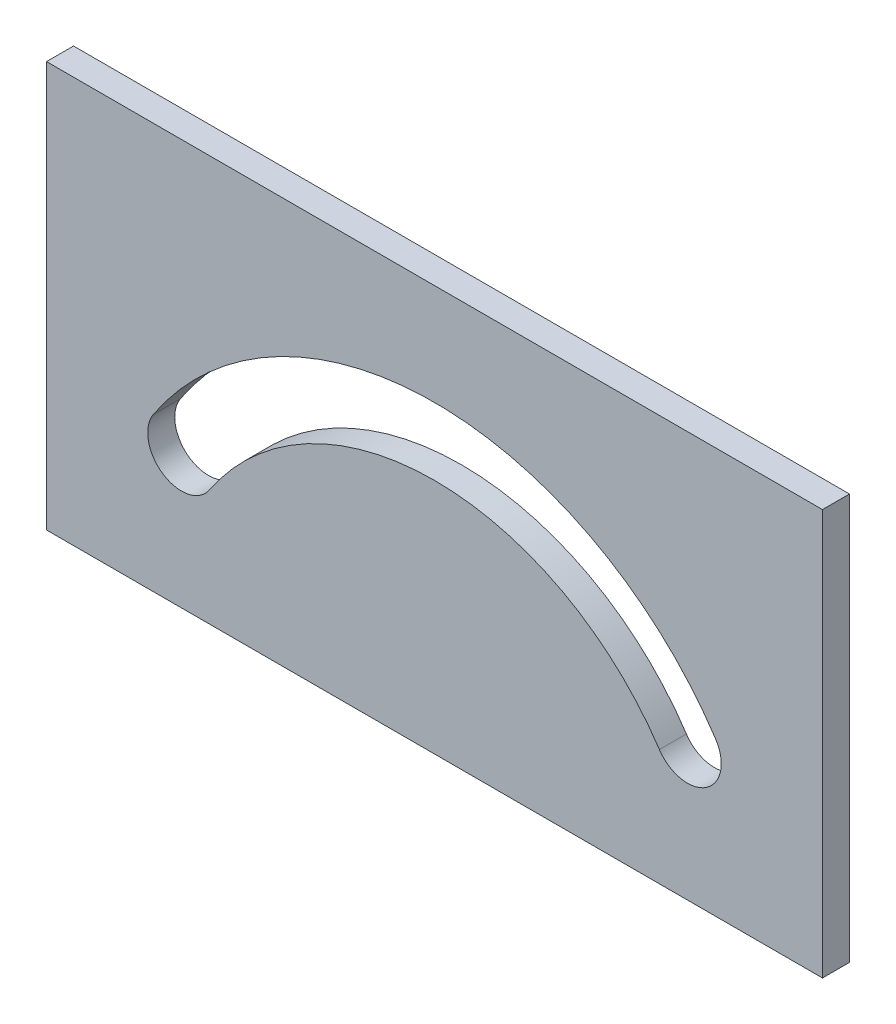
ISO-10303-21;
HEADER;
FILE_DESCRIPTION(('STEP AP214'),'2;1');
FILE_NAME('part.step','',(''),(''),'','','');
FILE_SCHEMA(('AUTOMOTIVE_DESIGN { 1 0 10303 214 1 1 1 1 }'));
ENDSEC;
DATA;
#1=APPLICATION_CONTEXT('core data for automotive mechanical design processes');
#2=APPLICATION_PROTOCOL_DEFINITION('international standard','automotive_design',2000,#1);
#3=PRODUCT_CONTEXT('',#1,'mechanical');
#4=PRODUCT('Part','Part','',(#3));
#5=PRODUCT_RELATED_PRODUCT_CATEGORY('part','',(#4));
#6=PRODUCT_DEFINITION_FORMATION('','',#4);
#7=PRODUCT_DEFINITION_CONTEXT('part definition',#1,'design');
#8=PRODUCT_DEFINITION('design','',#6,#7);
#9=PRODUCT_DEFINITION_SHAPE('','',#8);
#10=(LENGTH_UNIT() NAMED_UNIT(*) SI_UNIT(.MILLI.,.METRE.));
#11=(NAMED_UNIT(*) PLANE_ANGLE_UNIT() SI_UNIT($,.RADIAN.));
#12=(NAMED_UNIT(*) SI_UNIT($,.STERADIAN.) SOLID_ANGLE_UNIT());
#13=UNCERTAINTY_MEASURE_WITH_UNIT(LENGTH_MEASURE(1.E-05),#10,'distance_accuracy_value','');
#14=(GEOMETRIC_REPRESENTATION_CONTEXT(3) GLOBAL_UNCERTAINTY_ASSIGNED_CONTEXT((#13)) GLOBAL_UNIT_ASSIGNED_CONTEXT((#10,
#11,#12)) REPRESENTATION_CONTEXT('',''));
#15=CARTESIAN_POINT('',(0.,0.,0.));
#16=DIRECTION('',(0.,0.,1.));
#17=DIRECTION('',(1.,0.,0.));
#18=AXIS2_PLACEMENT_3D('',#15,#16,#17);
#19=CARTESIAN_POINT('',(-20.,-20.,4.));
#20=DIRECTION('',(0.,0.,1.));
#21=DIRECTION('',(1.,0.,0.));
#22=AXIS2_PLACEMENT_3D('',#19,#20,#21);
#23=PLANE('',#22);
#24=DIRECTION('',(0.,-1.,0.));
#25=VECTOR('',#24,1.);
#26=CARTESIAN_POINT('',(-20.,40.1253140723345,4.));
#27=LINE('',#26,#25);
#28=CARTESIAN_POINT('',(-20.,40.1253140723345,4.));
#29=VERTEX_POINT('',#28);
#30=CARTESIAN_POINT('',(-20.,-20.,4.));
#31=VERTEX_POINT('',#30);
#32=EDGE_CURVE('E138',#29,#31,#27,.T.);
#33=ORIENTED_EDGE('',*,*,#32,.T.);
#34=DIRECTION('',(1.,0.,0.));
#35=VECTOR('',#34,1.);
#36=CARTESIAN_POINT('',(-20.,-20.,4.));
#37=LINE('',#36,#35);
#38=CARTESIAN_POINT('',(95.,-20.,4.));
#39=VERTEX_POINT('',#38);
#40=EDGE_CURVE('E141',#31,#39,#37,.T.);
#41=ORIENTED_EDGE('',*,*,#40,.T.);
#42=DIRECTION('',(0.,1.,0.));
#43=VECTOR('',#42,1.);
#44=CARTESIAN_POINT('',(95.,40.1253140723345,4.));
#45=LINE('',#44,#43);
#46=CARTESIAN_POINT('',(95.,40.1253140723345,4.));
#47=VERTEX_POINT('',#46);
#48=EDGE_CURVE('E143',#39,#47,#45,.T.);
#49=ORIENTED_EDGE('',*,*,#48,.T.);
#50=DIRECTION('',(-1.,0.,0.));
#51=VECTOR('',#50,1.);
#52=CARTESIAN_POINT('',(-20.,40.1253140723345,4.));
#53=LINE('',#52,#51);
#54=EDGE_CURVE('E145',#47,#29,#53,.T.);
#55=ORIENTED_EDGE('',*,*,#54,.T.);
#56=EDGE_LOOP('',(#33,#41,#49,#55));
#57=FACE_BOUND('',#56,.T.);
#58=CARTESIAN_POINT('',(37.5,-24.8746859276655,4.));
#59=DIRECTION('',(0.,0.,-1.));
#60=DIRECTION('',(-1.,0.,0.));
#61=AXIS2_PLACEMENT_3D('',#58,#59,#60);
#62=CIRCLE('',#61,40.);
#63=CARTESIAN_POINT('',(4.16666666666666,-2.76385399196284,4.));
#64=VERTEX_POINT('',#63);
#65=CARTESIAN_POINT('',(70.8333333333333,-2.76385399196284,4.));
#66=VERTEX_POINT('',#65);
#67=EDGE_CURVE('E120',#64,#66,#62,.T.);
#68=ORIENTED_EDGE('',*,*,#67,.F.);
#69=CARTESIAN_POINT('',(0.,0.,4.));
#70=DIRECTION('',(0.,0.,1.));
#71=DIRECTION('',(-1.,0.,0.));
#72=AXIS2_PLACEMENT_3D('',#69,#70,#71);
#73=CIRCLE('',#72,5.);
#74=CARTESIAN_POINT('',(-4.16666666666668,2.76385399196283,4.));
#75=VERTEX_POINT('',#74);
#76=EDGE_CURVE('E109',#75,#64,#73,.T.);
#77=ORIENTED_EDGE('',*,*,#76,.F.);
#78=CARTESIAN_POINT('',(37.5,-24.8746859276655,4.));
#79=DIRECTION('',(0.,0.,1.));
#80=DIRECTION('',(-1.,0.,0.));
#81=AXIS2_PLACEMENT_3D('',#78,#79,#80);
#82=CIRCLE('',#81,50.);
#83=CARTESIAN_POINT('',(79.1666666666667,2.76385399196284,4.));
#84=VERTEX_POINT('',#83);
#85=EDGE_CURVE('E124',#84,#75,#82,.T.);
#86=ORIENTED_EDGE('',*,*,#85,.F.);
#87=CARTESIAN_POINT('',(75.,0.,4.));
#88=DIRECTION('',(0.,0.,1.));
#89=DIRECTION('',(1.,0.,0.));
#90=AXIS2_PLACEMENT_3D('',#87,#88,#89);
#91=CIRCLE('',#90,5.);
#92=EDGE_CURVE('E122',#66,#84,#91,.T.);
#93=ORIENTED_EDGE('',*,*,#92,.F.);
#94=EDGE_LOOP('',(#68,#77,#86,#93));
#95=FACE_BOUND('',#94,.T.);
#96=ADVANCED_FACE('F29',(#57,#95),#23,.T.);
#97=CARTESIAN_POINT('',(-20.,-20.,0.));
#98=DIRECTION('',(0.,0.,1.));
#99=DIRECTION('',(1.,0.,0.));
#100=AXIS2_PLACEMENT_3D('',#97,#98,#99);
#101=PLANE('',#100);
#102=DIRECTION('',(0.,-1.,0.));
#103=VECTOR('',#102,1.);
#104=CARTESIAN_POINT('',(-20.,40.1253140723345,0.));
#105=LINE('',#104,#103);
#106=CARTESIAN_POINT('',(-20.,40.1253140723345,0.));
#107=VERTEX_POINT('',#106);
#108=CARTESIAN_POINT('',(-20.,-20.,0.));
#109=VERTEX_POINT('',#108);
#110=EDGE_CURVE('E110',#107,#109,#105,.T.);
#111=ORIENTED_EDGE('',*,*,#110,.F.);
#112=DIRECTION('',(-1.,0.,0.));
#113=VECTOR('',#112,1.);
#114=CARTESIAN_POINT('',(-20.,40.1253140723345,0.));
#115=LINE('',#114,#113);
#116=CARTESIAN_POINT('',(95.,40.1253140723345,0.));
#117=VERTEX_POINT('',#116);
#118=EDGE_CURVE('E136',#117,#107,#115,.T.);
#119=ORIENTED_EDGE('',*,*,#118,.F.);
#120=DIRECTION('',(0.,1.,0.));
#121=VECTOR('',#120,1.);
#122=CARTESIAN_POINT('',(95.,40.1253140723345,0.));
#123=LINE('',#122,#121);
#124=CARTESIAN_POINT('',(95.,-20.,0.));
#125=VERTEX_POINT('',#124);
#126=EDGE_CURVE('E134',#125,#117,#123,.T.);
#127=ORIENTED_EDGE('',*,*,#126,.F.);
#128=DIRECTION('',(1.,0.,0.));
#129=VECTOR('',#128,1.);
#130=CARTESIAN_POINT('',(-20.,-20.,0.));
#131=LINE('',#130,#129);
#132=EDGE_CURVE('E132',#109,#125,#131,.T.);
#133=ORIENTED_EDGE('',*,*,#132,.F.);
#134=EDGE_LOOP('',(#111,#119,#127,#133));
#135=FACE_BOUND('',#134,.T.);
#136=CARTESIAN_POINT('',(0.,0.,0.));
#137=DIRECTION('',(0.,0.,1.));
#138=DIRECTION('',(-1.,0.,0.));
#139=AXIS2_PLACEMENT_3D('',#136,#137,#138);
#140=CIRCLE('',#139,5.);
#141=CARTESIAN_POINT('',(-4.16666666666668,2.76385399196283,0.));
#142=VERTEX_POINT('',#141);
#143=CARTESIAN_POINT('',(4.16666666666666,-2.76385399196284,0.));
#144=VERTEX_POINT('',#143);
#145=EDGE_CURVE('E52',#142,#144,#140,.T.);
#146=ORIENTED_EDGE('',*,*,#145,.T.);
#147=CARTESIAN_POINT('',(37.5,-24.8746859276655,0.));
#148=DIRECTION('',(0.,0.,-1.));
#149=DIRECTION('',(-1.,0.,0.));
#150=AXIS2_PLACEMENT_3D('',#147,#148,#149);
#151=CIRCLE('',#150,40.);
#152=CARTESIAN_POINT('',(70.8333333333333,-2.76385399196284,0.));
#153=VERTEX_POINT('',#152);
#154=EDGE_CURVE('E96',#144,#153,#151,.T.);
#155=ORIENTED_EDGE('',*,*,#154,.T.);
#156=CARTESIAN_POINT('',(75.,0.,0.));
#157=DIRECTION('',(0.,0.,1.));
#158=DIRECTION('',(1.,0.,0.));
#159=AXIS2_PLACEMENT_3D('',#156,#157,#158);
#160=CIRCLE('',#159,5.);
#161=CARTESIAN_POINT('',(79.1666666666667,2.76385399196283,0.));
#162=VERTEX_POINT('',#161);
#163=EDGE_CURVE('E105',#153,#162,#160,.T.);
#164=ORIENTED_EDGE('',*,*,#163,.T.);
#165=CARTESIAN_POINT('',(37.5,-24.8746859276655,0.));
#166=DIRECTION('',(0.,0.,1.));
#167=DIRECTION('',(-1.,0.,0.));
#168=AXIS2_PLACEMENT_3D('',#165,#166,#167);
#169=CIRCLE('',#168,50.);
#170=EDGE_CURVE('E114',#162,#142,#169,.T.);
#171=ORIENTED_EDGE('',*,*,#170,.T.);
#172=EDGE_LOOP('',(#146,#155,#164,#171));
#173=FACE_BOUND('',#172,.T.);
#174=ADVANCED_FACE('F113',(#135,#173),#101,.F.);
#175=CARTESIAN_POINT('',(-20.,40.1253140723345,4.));
#176=DIRECTION('',(1.,0.,0.));
#177=DIRECTION('',(0.,1.,0.));
#178=AXIS2_PLACEMENT_3D('',#175,#176,#177);
#179=PLANE('',#178);
#180=ORIENTED_EDGE('',*,*,#110,.T.);
#181=DIRECTION('',(0.,0.,-1.));
#182=VECTOR('',#181,1.);
#183=CARTESIAN_POINT('',(-20.,-20.,4.));
#184=LINE('',#183,#182);
#185=EDGE_CURVE('E11',#31,#109,#184,.T.);
#186=ORIENTED_EDGE('',*,*,#185,.F.);
#187=ORIENTED_EDGE('',*,*,#32,.F.);
#188=DIRECTION('',(0.,0.,-1.));
#189=VECTOR('',#188,1.);
#190=CARTESIAN_POINT('',(-20.,40.1253140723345,4.));
#191=LINE('',#190,#189);
#192=EDGE_CURVE('E147',#29,#107,#191,.T.);
#193=ORIENTED_EDGE('',*,*,#192,.T.);
#194=EDGE_LOOP('',(#180,#186,#187,#193));
#195=FACE_BOUND('',#194,.T.);
#196=ADVANCED_FACE('F31',(#195),#179,.F.);
#197=CARTESIAN_POINT('',(-20.,-20.,4.));
#198=DIRECTION('',(0.,1.,0.));
#199=DIRECTION('',(0.,0.,1.));
#200=AXIS2_PLACEMENT_3D('',#197,#198,#199);
#201=PLANE('',#200);
#202=ORIENTED_EDGE('',*,*,#132,.T.);
#203=DIRECTION('',(0.,0.,-1.));
#204=VECTOR('',#203,1.);
#205=CARTESIAN_POINT('',(95.,-20.,4.));
#206=LINE('',#205,#204);
#207=EDGE_CURVE('E37',#39,#125,#206,.T.);
#208=ORIENTED_EDGE('',*,*,#207,.F.);
#209=ORIENTED_EDGE('',*,*,#40,.F.);
#210=ORIENTED_EDGE('',*,*,#185,.T.);
#211=EDGE_LOOP('',(#202,#208,#209,#210));
#212=FACE_BOUND('',#211,.T.);
#213=ADVANCED_FACE('F172',(#212),#201,.F.);
#214=CARTESIAN_POINT('',(95.,40.1253140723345,4.));
#215=DIRECTION('',(-1.,0.,0.));
#216=DIRECTION('',(0.,0.,1.));
#217=AXIS2_PLACEMENT_3D('',#214,#215,#216);
#218=PLANE('',#217);
#219=ORIENTED_EDGE('',*,*,#126,.T.);
#220=DIRECTION('',(0.,0.,-1.));
#221=VECTOR('',#220,1.);
#222=CARTESIAN_POINT('',(95.,40.1253140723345,4.));
#223=LINE('',#222,#221);
#224=EDGE_CURVE('E150',#47,#117,#223,.T.);
#225=ORIENTED_EDGE('',*,*,#224,.F.);
#226=ORIENTED_EDGE('',*,*,#48,.F.);
#227=ORIENTED_EDGE('',*,*,#207,.T.);
#228=EDGE_LOOP('',(#219,#225,#226,#227));
#229=FACE_BOUND('',#228,.T.);
#230=ADVANCED_FACE('F157',(#229),#218,.F.);
#231=CARTESIAN_POINT('',(-20.,40.1253140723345,4.));
#232=DIRECTION('',(0.,-1.,0.));
#233=DIRECTION('',(0.,0.,-1.));
#234=AXIS2_PLACEMENT_3D('',#231,#232,#233);
#235=PLANE('',#234);
#236=ORIENTED_EDGE('',*,*,#118,.T.);
#237=ORIENTED_EDGE('',*,*,#192,.F.);
#238=ORIENTED_EDGE('',*,*,#54,.F.);
#239=ORIENTED_EDGE('',*,*,#224,.T.);
#240=EDGE_LOOP('',(#236,#237,#238,#239));
#241=FACE_BOUND('',#240,.T.);
#242=ADVANCED_FACE('F165',(#241),#235,.F.);
#243=CARTESIAN_POINT('',(0.,0.,4.));
#244=DIRECTION('',(0.,0.,-1.));
#245=DIRECTION('',(-1.,0.,0.));
#246=AXIS2_PLACEMENT_3D('',#243,#244,#245);
#247=CYLINDRICAL_SURFACE('',#246,5.);
#248=ORIENTED_EDGE('',*,*,#145,.F.);
#249=DIRECTION('',(0.,0.,-1.));
#250=VECTOR('',#249,1.);
#251=CARTESIAN_POINT('',(-4.16666666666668,2.76385399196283,4.));
#252=LINE('',#251,#250);
#253=EDGE_CURVE('E126',#75,#142,#252,.T.);
#254=ORIENTED_EDGE('',*,*,#253,.F.);
#255=ORIENTED_EDGE('',*,*,#76,.T.);
#256=DIRECTION('',(0.,0.,-1.));
#257=VECTOR('',#256,1.);
#258=CARTESIAN_POINT('',(4.16666666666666,-2.76385399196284,4.));
#259=LINE('',#258,#257);
#260=EDGE_CURVE('E98',#64,#144,#259,.T.);
#261=ORIENTED_EDGE('',*,*,#260,.T.);
#262=EDGE_LOOP('',(#248,#254,#255,#261));
#263=FACE_BOUND('',#262,.T.);
#264=ADVANCED_FACE('F107',(#263),#247,.F.);
#265=CARTESIAN_POINT('',(37.5,-24.8746859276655,4.));
#266=DIRECTION('',(0.,0.,-1.));
#267=DIRECTION('',(-1.,0.,0.));
#268=AXIS2_PLACEMENT_3D('',#265,#266,#267);
#269=CYLINDRICAL_SURFACE('',#268,40.);
#270=ORIENTED_EDGE('',*,*,#154,.F.);
#271=ORIENTED_EDGE('',*,*,#260,.F.);
#272=ORIENTED_EDGE('',*,*,#67,.T.);
#273=DIRECTION('',(0.,0.,-1.));
#274=VECTOR('',#273,1.);
#275=CARTESIAN_POINT('',(70.8333333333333,-2.76385399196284,4.));
#276=LINE('',#275,#274);
#277=EDGE_CURVE('E101',#66,#153,#276,.T.);
#278=ORIENTED_EDGE('',*,*,#277,.T.);
#279=EDGE_LOOP('',(#270,#271,#272,#278));
#280=FACE_BOUND('',#279,.T.);
#281=ADVANCED_FACE('F97',(#280),#269,.T.);
#282=CARTESIAN_POINT('',(75.,0.,4.));
#283=DIRECTION('',(0.,0.,-1.));
#284=DIRECTION('',(-1.,0.,0.));
#285=AXIS2_PLACEMENT_3D('',#282,#283,#284);
#286=CYLINDRICAL_SURFACE('',#285,5.);
#287=ORIENTED_EDGE('',*,*,#163,.F.);
#288=ORIENTED_EDGE('',*,*,#277,.F.);
#289=ORIENTED_EDGE('',*,*,#92,.T.);
#290=DIRECTION('',(0.,0.,-1.));
#291=VECTOR('',#290,1.);
#292=CARTESIAN_POINT('',(79.1666666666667,2.76385399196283,4.));
#293=LINE('',#292,#291);
#294=EDGE_CURVE('E44',#84,#162,#293,.T.);
#295=ORIENTED_EDGE('',*,*,#294,.T.);
#296=EDGE_LOOP('',(#287,#288,#289,#295));
#297=FACE_BOUND('',#296,.T.);
#298=ADVANCED_FACE('F194',(#297),#286,.F.);
#299=CARTESIAN_POINT('',(37.5,-24.8746859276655,4.));
#300=DIRECTION('',(0.,0.,-1.));
#301=DIRECTION('',(-1.,0.,0.));
#302=AXIS2_PLACEMENT_3D('',#299,#300,#301);
#303=CYLINDRICAL_SURFACE('',#302,50.);
#304=ORIENTED_EDGE('',*,*,#170,.F.);
#305=ORIENTED_EDGE('',*,*,#294,.F.);
#306=ORIENTED_EDGE('',*,*,#85,.T.);
#307=ORIENTED_EDGE('',*,*,#253,.T.);
#308=EDGE_LOOP('',(#304,#305,#306,#307));
#309=FACE_BOUND('',#308,.T.);
#310=ADVANCED_FACE('F199',(#309),#303,.F.);
#311=CLOSED_SHELL('',(#96,#174,#196,#213,#230,#242,#264,#281,#298,#310));
#312=MANIFOLD_SOLID_BREP('B2',#311);
#313=ADVANCED_BREP_SHAPE_REPRESENTATION('',(#18,#312),#14);
#314=SHAPE_DEFINITION_REPRESENTATION(#9,#313);
ENDSEC;
END-ISO-10303-21;
